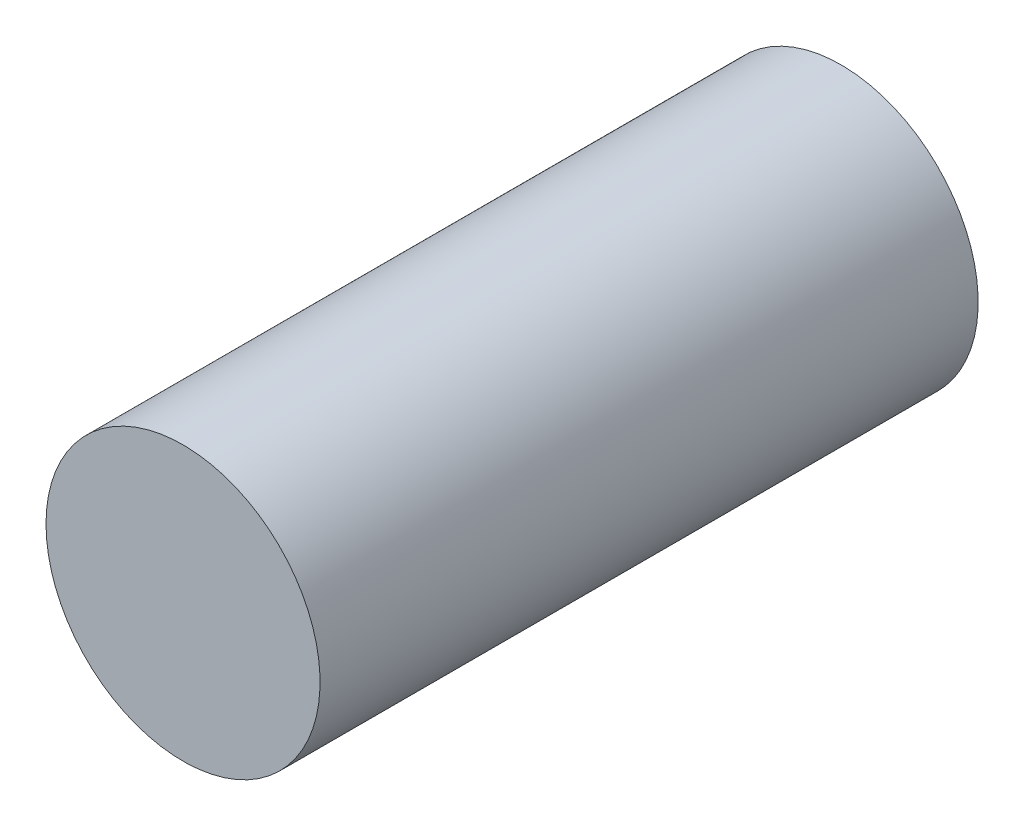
from build123d import *

# Parameters (mm, degrees)
SKETCH1_R           = 73.513458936
BOSS_EXTRUDE1_DEPTH = 353.06


with BuildPart() as part:
    # Sketch1 → Boss-Extrude1 (new body)
    with BuildSketch(Plane.XY):
        with Locations(Location((0, 0, 0), (0, 0, 180))):
            Circle(SKETCH1_R)
    extrude(amount=BOSS_EXTRUDE1_DEPTH)


solid = part.part
